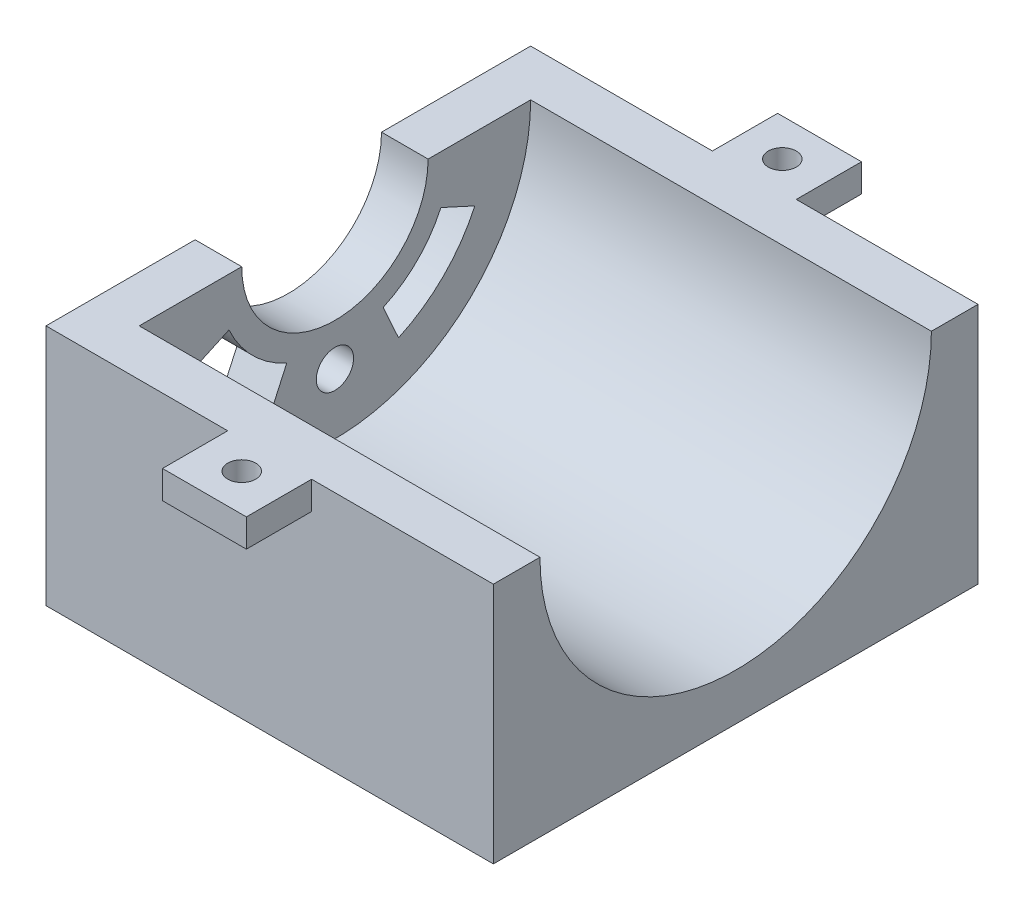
from build123d import *

# Parameters (mm, degrees)
SKETCH_1_W          = 48
SKETCH_1_H          = 52
EXTRUDE_1_DEPTH     = 26
CUT_EXTRUDE_1_DEPTH = 43
SKETCH_3_R          = 10
CUT_EXTRUDE_2_DEPTH = 72.220307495
SKETCH_3_3_R        = 2
CUT_EXTRUDE_3_DEPTH = 72.220307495
SKETCH_4_W          = 9
SKETCH_4_H          = 7
SKETCH_4_R          = 1.5
EXTRUDE_2_DEPTH     = 3


with BuildPart() as part:
    # Sketch 1 → Extrude 1 (new body)
    with BuildSketch(Plane(origin=(0, 0, 0), x_dir=(1, 0, 0), z_dir=(0, 1, 0))):
        with Locations((-3.522349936, -19.74201788)):
            Rectangle(SKETCH_1_W, SKETCH_1_H)
    extrude(amount=EXTRUDE_1_DEPTH)

    # Sketch 2 → Cut-Extrude 1 (cut)
    with BuildSketch(Plane(origin=(20.477650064, 0, 0), x_dir=(0, 0, -1), z_dir=(1, 0, 0))):
        with BuildLine():
            Line((1.25798212, 26), (-19.74201788, 26))
            Line((-19.74201788, 26), (-19.74201788, 5))
            ThreePointArc((-19.74201788, 5), (-4.892775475, 11.150757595), (1.25798212, 26))
        make_face()
        with BuildLine():
            Line((-40.74201788, 26), (-19.74201788, 26))
            Line((-19.74201788, 26), (1.25798212, 26))
            ThreePointArc((1.25798212, 26), (-19.74201788, 47), (-40.74201788, 26))
        make_face()
        with BuildLine():
            Line((-19.74201788, 5), (-19.74201788, 26))
            Line((-19.74201788, 26), (-40.74201788, 26))
            ThreePointArc((-40.74201788, 26), (-34.591260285, 11.150757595), (-19.74201788, 5))
        make_face()
        with BuildLine():
            Line((1.25798212, 26), (-19.74201788, 26))
            Line((-19.74201788, 26), (-19.74201788, 5))
            ThreePointArc((-19.74201788, 5), (-4.892775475, 11.150757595), (1.25798212, 26))
        make_face()
        with BuildLine():
            Line((-40.74201788, 26), (-19.74201788, 26))
            Line((-19.74201788, 26), (1.25798212, 26))
            ThreePointArc((1.25798212, 26), (-19.74201788, 47), (-40.74201788, 26))
        make_face()
        with BuildLine():
            Line((-19.74201788, 5), (-19.74201788, 26))
            Line((-19.74201788, 26), (-40.74201788, 26))
            ThreePointArc((-40.74201788, 26), (-34.591260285, 11.150757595), (-19.74201788, 5))
        make_face()
    extrude(amount=-CUT_EXTRUDE_1_DEPTH, mode=Mode.SUBTRACT)

    # Sketch 3 → Cut-Extrude 2 (cut, through all)
    with BuildSketch(Plane.ZY.offset(27.522349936)):
        with Locations((19.74201788, 26)):
            Circle(SKETCH_3_R)
    extrude(amount=-CUT_EXTRUDE_2_DEPTH, mode=Mode.SUBTRACT)

    # Sketch 3_3 → Cut-Extrude 3 (cut, through all)
    with BuildSketch(Plane.ZY.offset(27.522349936)):
        with BuildLine():
            ThreePointArc((14.569604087, 14.620363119), (10.911928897, 17.152428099), (8.372634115, 20.805087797))
            Line((8.372634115, 20.805087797), (4.73443131, 19.142715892))
            ThreePointArc((4.73443131, 19.142715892), (8.086300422, 14.32120509), (12.914431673, 10.978879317))
            Line((12.914431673, 10.978879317), (14.569604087, 14.620363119))
        make_face()
        with BuildLine():
            ThreePointArc((31.111401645, 20.805087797), (28.572106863, 17.152428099), (24.914431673, 14.620363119))
            Line((24.914431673, 14.620363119), (26.569604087, 10.978879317))
            ThreePointArc((26.569604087, 10.978879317), (31.397735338, 14.32120509), (34.74960445, 19.142715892))
            Line((34.74960445, 19.142715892), (31.111401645, 20.805087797))
        make_face()
        with Locations((19.74201788, 11.5)):
            Circle(SKETCH_3_3_R)
    extrude(amount=-CUT_EXTRUDE_3_DEPTH, mode=Mode.SUBTRACT)

    # Sketch 4 → Extrude 2 (add)
    # profile 1 of 4: a face of its own
    with BuildSketch(Plane(origin=(0, 26, 0), x_dir=(1, 0, 0), z_dir=(0, 1, 0))):
        with Locations((-3.522349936, 9.75798212)):
            Rectangle(SKETCH_4_W, SKETCH_4_H)
        with Locations(Location((-3.522349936, 9.25798212, 0), (0, 0, 270))):
            Circle(SKETCH_4_R, mode=Mode.SUBTRACT)
    # profile 2 of 4: a face of its own
    with BuildSketch(Plane(origin=(0, 26, 0), x_dir=(1, 0, 0), z_dir=(0, 1, 0))):
        Polygon((-22.522349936, -29.74201788), (-27.522349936, -29.74201788), (-27.522349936, -45.74201788), (20.477650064, -45.74201788), (20.477650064, -40.74201788), (-22.522349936, -40.74201788), align=None)
    # profile 3 of 4: a face of its own
    with BuildSketch(Plane(origin=(0, 26, 0), x_dir=(1, 0, 0), z_dir=(0, 1, 0))):
        Polygon((-27.522349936, -9.74201788), (-22.522349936, -9.74201788), (-22.522349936, 1.25798212), (20.477650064, 1.25798212), (20.477650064, 6.25798212), (-27.522349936, 6.25798212), align=None)
    # profile 4 of 4: a face of its own
    with BuildSketch(Plane(origin=(0, 26, 0), x_dir=(1, 0, 0), z_dir=(0, 1, 0))):
        with Locations((-3.522349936, -49.24201788)):
            Rectangle(SKETCH_4_W, SKETCH_4_H)
        with Locations(Location((-3.522349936, -48.74201788, 0), (0, 0, 270))):
            Circle(SKETCH_4_R, mode=Mode.SUBTRACT)
    extrude(amount=-EXTRUDE_2_DEPTH)


solid = part.part
